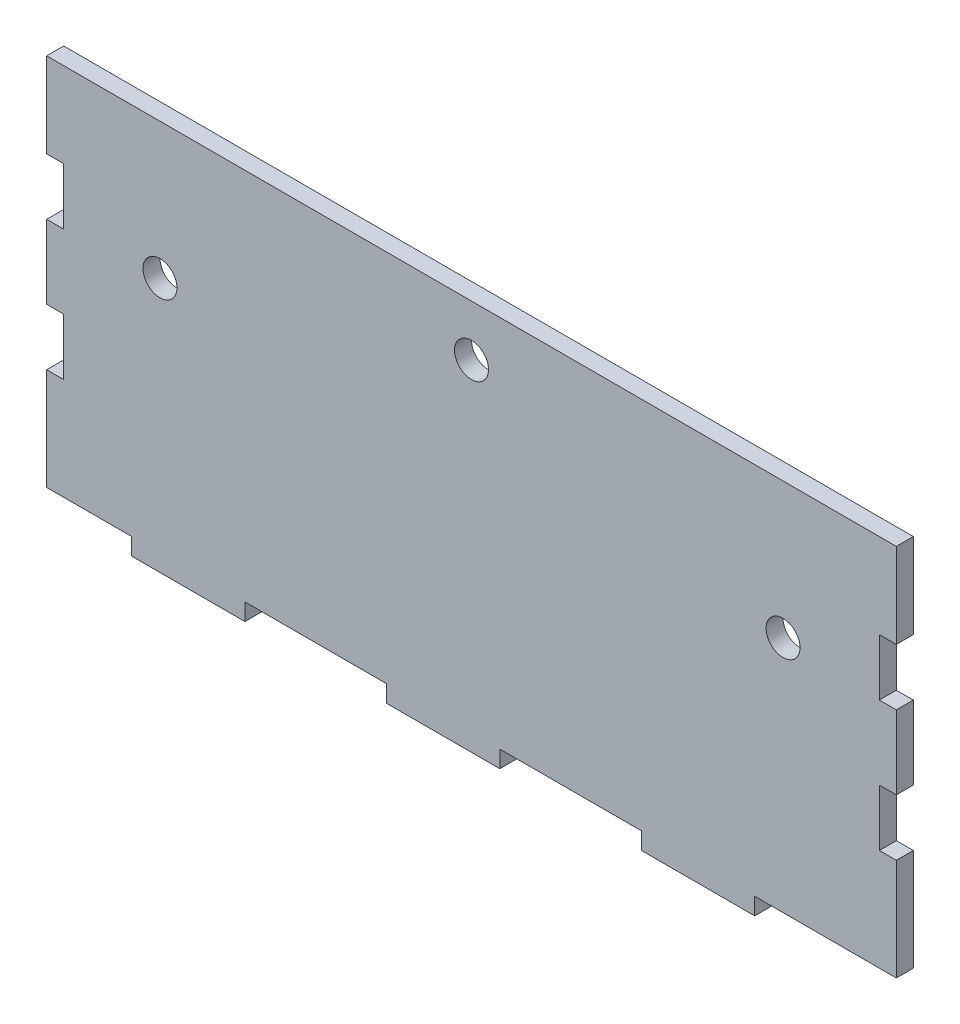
ISO-10303-21;
HEADER;
FILE_DESCRIPTION(('STEP AP214'),'2;1');
FILE_NAME('part.step','',(''),(''),'','','');
FILE_SCHEMA(('AUTOMOTIVE_DESIGN { 1 0 10303 214 1 1 1 1 }'));
ENDSEC;
DATA;
#1=APPLICATION_CONTEXT('core data for automotive mechanical design processes');
#2=APPLICATION_PROTOCOL_DEFINITION('international standard','automotive_design',2000,#1);
#3=PRODUCT_CONTEXT('',#1,'mechanical');
#4=PRODUCT('Part','Part','',(#3));
#5=PRODUCT_RELATED_PRODUCT_CATEGORY('part','',(#4));
#6=PRODUCT_DEFINITION_FORMATION('','',#4);
#7=PRODUCT_DEFINITION_CONTEXT('part definition',#1,'design');
#8=PRODUCT_DEFINITION('design','',#6,#7);
#9=PRODUCT_DEFINITION_SHAPE('','',#8);
#10=(LENGTH_UNIT() NAMED_UNIT(*) SI_UNIT(.MILLI.,.METRE.));
#11=(NAMED_UNIT(*) PLANE_ANGLE_UNIT() SI_UNIT($,.RADIAN.));
#12=(NAMED_UNIT(*) SI_UNIT($,.STERADIAN.) SOLID_ANGLE_UNIT());
#13=UNCERTAINTY_MEASURE_WITH_UNIT(LENGTH_MEASURE(1.E-05),#10,'distance_accuracy_value','');
#14=(GEOMETRIC_REPRESENTATION_CONTEXT(3) GLOBAL_UNCERTAINTY_ASSIGNED_CONTEXT((#13)) GLOBAL_UNIT_ASSIGNED_CONTEXT((#10,
#11,#12)) REPRESENTATION_CONTEXT('',''));
#15=CARTESIAN_POINT('',(0.,0.,0.));
#16=DIRECTION('',(0.,0.,1.));
#17=DIRECTION('',(1.,0.,0.));
#18=AXIS2_PLACEMENT_3D('',#15,#16,#17);
#19=CARTESIAN_POINT('',(0.,0.,3.));
#20=DIRECTION('',(1.,0.,0.));
#21=DIRECTION('',(0.,0.,-1.));
#22=AXIS2_PLACEMENT_3D('',#19,#20,#21);
#23=PLANE('',#22);
#24=DIRECTION('',(0.,-1.,0.));
#25=VECTOR('',#24,1.);
#26=CARTESIAN_POINT('',(0.,0.,3.));
#27=LINE('',#26,#25);
#28=CARTESIAN_POINT('',(0.,44.,3.));
#29=VERTEX_POINT('',#28);
#30=CARTESIAN_POINT('',(0.,31.,3.));
#31=VERTEX_POINT('',#30);
#32=EDGE_CURVE('E277',#29,#31,#27,.T.);
#33=ORIENTED_EDGE('',*,*,#32,.F.);
#34=DIRECTION('',(0.,0.,1.));
#35=VECTOR('',#34,1.);
#36=CARTESIAN_POINT('',(0.,44.,-3.));
#37=LINE('',#36,#35);
#38=CARTESIAN_POINT('',(0.,44.,0.));
#39=VERTEX_POINT('',#38);
#40=EDGE_CURVE('E555',#39,#29,#37,.T.);
#41=ORIENTED_EDGE('',*,*,#40,.F.);
#42=DIRECTION('',(0.,-1.,0.));
#43=VECTOR('',#42,1.);
#44=CARTESIAN_POINT('',(0.,0.,0.));
#45=LINE('',#44,#43);
#46=CARTESIAN_POINT('',(0.,31.,0.));
#47=VERTEX_POINT('',#46);
#48=EDGE_CURVE('E332',#39,#47,#45,.T.);
#49=ORIENTED_EDGE('',*,*,#48,.T.);
#50=DIRECTION('',(0.,0.,1.));
#51=VECTOR('',#50,1.);
#52=CARTESIAN_POINT('',(0.,31.,-3.));
#53=LINE('',#52,#51);
#54=EDGE_CURVE('E562',#47,#31,#53,.T.);
#55=ORIENTED_EDGE('',*,*,#54,.T.);
#56=EDGE_LOOP('',(#33,#41,#49,#55));
#57=FACE_BOUND('',#56,.T.);
#58=ADVANCED_FACE('F39',(#57),#23,.F.);
#59=CARTESIAN_POINT('',(0.,69.,3.));
#60=VERTEX_POINT('',#59);
#61=CARTESIAN_POINT('',(0.,54.,3.));
#62=VERTEX_POINT('',#61);
#63=EDGE_CURVE('E265',#60,#62,#27,.T.);
#64=ORIENTED_EDGE('',*,*,#63,.F.);
#65=DIRECTION('',(0.,0.,1.));
#66=VECTOR('',#65,1.);
#67=CARTESIAN_POINT('',(0.,69.,-3.));
#68=LINE('',#67,#66);
#69=CARTESIAN_POINT('',(0.,69.,0.));
#70=VERTEX_POINT('',#69);
#71=EDGE_CURVE('E247',#70,#60,#68,.T.);
#72=ORIENTED_EDGE('',*,*,#71,.F.);
#73=CARTESIAN_POINT('',(0.,54.,0.));
#74=VERTEX_POINT('',#73);
#75=EDGE_CURVE('E326',#70,#74,#45,.T.);
#76=ORIENTED_EDGE('',*,*,#75,.T.);
#77=DIRECTION('',(0.,0.,1.));
#78=VECTOR('',#77,1.);
#79=CARTESIAN_POINT('',(0.,54.,-3.));
#80=LINE('',#79,#78);
#81=EDGE_CURVE('E274',#74,#62,#80,.T.);
#82=ORIENTED_EDGE('',*,*,#81,.T.);
#83=EDGE_LOOP('',(#64,#72,#76,#82));
#84=FACE_BOUND('',#83,.T.);
#85=ADVANCED_FACE('F273',(#84),#23,.F.);
#86=CARTESIAN_POINT('',(0.,0.,3.));
#87=DIRECTION('',(0.,1.,0.));
#88=DIRECTION('',(0.,0.,1.));
#89=AXIS2_PLACEMENT_3D('',#86,#87,#88);
#90=PLANE('',#89);
#91=DIRECTION('',(1.,0.,0.));
#92=VECTOR('',#91,1.);
#93=CARTESIAN_POINT('',(0.,0.,0.));
#94=LINE('',#93,#92);
#95=CARTESIAN_POINT('',(60.,0.,0.));
#96=VERTEX_POINT('',#95);
#97=CARTESIAN_POINT('',(80.,0.,0.));
#98=VERTEX_POINT('',#97);
#99=EDGE_CURVE('E315',#96,#98,#94,.T.);
#100=ORIENTED_EDGE('',*,*,#99,.T.);
#101=DIRECTION('',(0.,0.,1.));
#102=VECTOR('',#101,1.);
#103=CARTESIAN_POINT('',(80.,0.,-3.));
#104=LINE('',#103,#102);
#105=CARTESIAN_POINT('',(80.,0.,3.));
#106=VERTEX_POINT('',#105);
#107=EDGE_CURVE('E459',#98,#106,#104,.T.);
#108=ORIENTED_EDGE('',*,*,#107,.T.);
#109=DIRECTION('',(1.,0.,0.));
#110=VECTOR('',#109,1.);
#111=CARTESIAN_POINT('',(0.,0.,3.));
#112=LINE('',#111,#110);
#113=CARTESIAN_POINT('',(60.,0.,3.));
#114=VERTEX_POINT('',#113);
#115=EDGE_CURVE('E283',#114,#106,#112,.T.);
#116=ORIENTED_EDGE('',*,*,#115,.F.);
#117=DIRECTION('',(0.,0.,1.));
#118=VECTOR('',#117,1.);
#119=CARTESIAN_POINT('',(60.,0.,-3.));
#120=LINE('',#119,#118);
#121=EDGE_CURVE('E457',#96,#114,#120,.T.);
#122=ORIENTED_EDGE('',*,*,#121,.F.);
#123=EDGE_LOOP('',(#100,#108,#116,#122));
#124=FACE_BOUND('',#123,.T.);
#125=ADVANCED_FACE('F456',(#124),#90,.F.);
#126=CARTESIAN_POINT('',(15.,0.,0.));
#127=VERTEX_POINT('',#126);
#128=CARTESIAN_POINT('',(35.,0.,0.));
#129=VERTEX_POINT('',#128);
#130=EDGE_CURVE('E309',#127,#129,#94,.T.);
#131=ORIENTED_EDGE('',*,*,#130,.T.);
#132=DIRECTION('',(0.,0.,1.));
#133=VECTOR('',#132,1.);
#134=CARTESIAN_POINT('',(35.,0.,-3.));
#135=LINE('',#134,#133);
#136=CARTESIAN_POINT('',(35.,0.,3.));
#137=VERTEX_POINT('',#136);
#138=EDGE_CURVE('E485',#129,#137,#135,.T.);
#139=ORIENTED_EDGE('',*,*,#138,.T.);
#140=CARTESIAN_POINT('',(15.,0.,3.));
#141=VERTEX_POINT('',#140);
#142=EDGE_CURVE('E285',#141,#137,#112,.T.);
#143=ORIENTED_EDGE('',*,*,#142,.F.);
#144=DIRECTION('',(0.,0.,1.));
#145=VECTOR('',#144,1.);
#146=CARTESIAN_POINT('',(15.,0.,-3.));
#147=LINE('',#146,#145);
#148=EDGE_CURVE('E542',#127,#141,#147,.T.);
#149=ORIENTED_EDGE('',*,*,#148,.F.);
#150=EDGE_LOOP('',(#131,#139,#143,#149));
#151=FACE_BOUND('',#150,.T.);
#152=ADVANCED_FACE('F494',(#151),#90,.F.);
#153=CARTESIAN_POINT('',(150.,0.,3.));
#154=DIRECTION('',(-1.,0.,0.));
#155=DIRECTION('',(0.,0.,1.));
#156=AXIS2_PLACEMENT_3D('',#153,#154,#155);
#157=PLANE('',#156);
#158=DIRECTION('',(0.,1.,0.));
#159=VECTOR('',#158,1.);
#160=CARTESIAN_POINT('',(150.,0.,0.));
#161=LINE('',#160,#159);
#162=CARTESIAN_POINT('',(150.,31.,0.));
#163=VERTEX_POINT('',#162);
#164=CARTESIAN_POINT('',(150.,44.,0.));
#165=VERTEX_POINT('',#164);
#166=EDGE_CURVE('E296',#163,#165,#161,.T.);
#167=ORIENTED_EDGE('',*,*,#166,.T.);
#168=DIRECTION('',(0.,0.,1.));
#169=VECTOR('',#168,1.);
#170=CARTESIAN_POINT('',(150.,44.,-3.));
#171=LINE('',#170,#169);
#172=CARTESIAN_POINT('',(150.,44.,3.));
#173=VERTEX_POINT('',#172);
#174=EDGE_CURVE('E270',#165,#173,#171,.T.);
#175=ORIENTED_EDGE('',*,*,#174,.T.);
#176=DIRECTION('',(0.,1.,0.));
#177=VECTOR('',#176,1.);
#178=CARTESIAN_POINT('',(150.,0.,3.));
#179=LINE('',#178,#177);
#180=CARTESIAN_POINT('',(150.,31.,3.));
#181=VERTEX_POINT('',#180);
#182=EDGE_CURVE('E431',#181,#173,#179,.T.);
#183=ORIENTED_EDGE('',*,*,#182,.F.);
#184=DIRECTION('',(0.,0.,1.));
#185=VECTOR('',#184,1.);
#186=CARTESIAN_POINT('',(150.,31.,-3.));
#187=LINE('',#186,#185);
#188=EDGE_CURVE('E636',#163,#181,#187,.T.);
#189=ORIENTED_EDGE('',*,*,#188,.F.);
#190=EDGE_LOOP('',(#167,#175,#183,#189));
#191=FACE_BOUND('',#190,.T.);
#192=ADVANCED_FACE('F533',(#191),#157,.F.);
#193=CARTESIAN_POINT('',(150.,54.,0.));
#194=VERTEX_POINT('',#193);
#195=CARTESIAN_POINT('',(150.,69.,0.));
#196=VERTEX_POINT('',#195);
#197=EDGE_CURVE('E298',#194,#196,#161,.T.);
#198=ORIENTED_EDGE('',*,*,#197,.T.);
#199=DIRECTION('',(0.,0.,1.));
#200=VECTOR('',#199,1.);
#201=CARTESIAN_POINT('',(150.,69.,-3.));
#202=LINE('',#201,#200);
#203=CARTESIAN_POINT('',(150.,69.,3.));
#204=VERTEX_POINT('',#203);
#205=EDGE_CURVE('E258',#196,#204,#202,.T.);
#206=ORIENTED_EDGE('',*,*,#205,.T.);
#207=CARTESIAN_POINT('',(150.,54.,3.));
#208=VERTEX_POINT('',#207);
#209=EDGE_CURVE('E268',#208,#204,#179,.T.);
#210=ORIENTED_EDGE('',*,*,#209,.F.);
#211=DIRECTION('',(0.,0.,1.));
#212=VECTOR('',#211,1.);
#213=CARTESIAN_POINT('',(150.,54.,-3.));
#214=LINE('',#213,#212);
#215=EDGE_CURVE('E585',#194,#208,#214,.T.);
#216=ORIENTED_EDGE('',*,*,#215,.F.);
#217=EDGE_LOOP('',(#198,#206,#210,#216));
#218=FACE_BOUND('',#217,.T.);
#219=ADVANCED_FACE('F527',(#218),#157,.F.);
#220=CARTESIAN_POINT('',(0.,21.,3.));
#221=VERTEX_POINT('',#220);
#222=CARTESIAN_POINT('',(0.,3.,3.));
#223=VERTEX_POINT('',#222);
#224=EDGE_CURVE('E279',#221,#223,#27,.T.);
#225=ORIENTED_EDGE('',*,*,#224,.F.);
#226=DIRECTION('',(0.,0.,1.));
#227=VECTOR('',#226,1.);
#228=CARTESIAN_POINT('',(0.,21.,-3.));
#229=LINE('',#228,#227);
#230=CARTESIAN_POINT('',(0.,21.,0.));
#231=VERTEX_POINT('',#230);
#232=EDGE_CURVE('E535',#231,#221,#229,.T.);
#233=ORIENTED_EDGE('',*,*,#232,.F.);
#234=CARTESIAN_POINT('',(0.,3.,0.));
#235=VERTEX_POINT('',#234);
#236=EDGE_CURVE('E333',#231,#235,#45,.T.);
#237=ORIENTED_EDGE('',*,*,#236,.T.);
#238=DIRECTION('',(0.,0.,1.));
#239=VECTOR('',#238,1.);
#240=CARTESIAN_POINT('',(0.,3.,-3.));
#241=LINE('',#240,#239);
#242=EDGE_CURVE('E478',#235,#223,#241,.T.);
#243=ORIENTED_EDGE('',*,*,#242,.T.);
#244=EDGE_LOOP('',(#225,#233,#237,#243));
#245=FACE_BOUND('',#244,.T.);
#246=ADVANCED_FACE('F41',(#245),#23,.F.);
#247=CARTESIAN_POINT('',(105.,0.,0.));
#248=VERTEX_POINT('',#247);
#249=CARTESIAN_POINT('',(125.,0.,0.));
#250=VERTEX_POINT('',#249);
#251=EDGE_CURVE('E316',#248,#250,#94,.T.);
#252=ORIENTED_EDGE('',*,*,#251,.T.);
#253=DIRECTION('',(0.,0.,1.));
#254=VECTOR('',#253,1.);
#255=CARTESIAN_POINT('',(125.,0.,-3.));
#256=LINE('',#255,#254);
#257=CARTESIAN_POINT('',(125.,0.,3.));
#258=VERTEX_POINT('',#257);
#259=EDGE_CURVE('E603',#250,#258,#256,.T.);
#260=ORIENTED_EDGE('',*,*,#259,.T.);
#261=CARTESIAN_POINT('',(105.,0.,3.));
#262=VERTEX_POINT('',#261);
#263=EDGE_CURVE('E276',#262,#258,#112,.T.);
#264=ORIENTED_EDGE('',*,*,#263,.F.);
#265=DIRECTION('',(0.,0.,1.));
#266=VECTOR('',#265,1.);
#267=CARTESIAN_POINT('',(105.,0.,-3.));
#268=LINE('',#267,#266);
#269=EDGE_CURVE('E463',#248,#262,#268,.T.);
#270=ORIENTED_EDGE('',*,*,#269,.F.);
#271=EDGE_LOOP('',(#252,#260,#264,#270));
#272=FACE_BOUND('',#271,.T.);
#273=ADVANCED_FACE('F526',(#272),#90,.F.);
#274=CARTESIAN_POINT('',(150.,3.,3.));
#275=VERTEX_POINT('',#274);
#276=CARTESIAN_POINT('',(150.,21.,3.));
#277=VERTEX_POINT('',#276);
#278=EDGE_CURVE('E426',#275,#277,#179,.T.);
#279=ORIENTED_EDGE('',*,*,#278,.F.);
#280=DIRECTION('',(0.,0.,1.));
#281=VECTOR('',#280,1.);
#282=CARTESIAN_POINT('',(150.,3.,-3.));
#283=LINE('',#282,#281);
#284=CARTESIAN_POINT('',(150.,3.,0.));
#285=VERTEX_POINT('',#284);
#286=EDGE_CURVE('E606',#285,#275,#283,.T.);
#287=ORIENTED_EDGE('',*,*,#286,.F.);
#288=CARTESIAN_POINT('',(150.,21.,0.));
#289=VERTEX_POINT('',#288);
#290=EDGE_CURVE('E290',#285,#289,#161,.T.);
#291=ORIENTED_EDGE('',*,*,#290,.T.);
#292=DIRECTION('',(0.,0.,1.));
#293=VECTOR('',#292,1.);
#294=CARTESIAN_POINT('',(150.,21.,-3.));
#295=LINE('',#294,#293);
#296=EDGE_CURVE('E633',#289,#277,#295,.T.);
#297=ORIENTED_EDGE('',*,*,#296,.T.);
#298=EDGE_LOOP('',(#279,#287,#291,#297));
#299=FACE_BOUND('',#298,.T.);
#300=ADVANCED_FACE('F532',(#299),#157,.F.);
#301=CARTESIAN_POINT('',(0.,0.,3.));
#302=DIRECTION('',(0.,0.,-1.));
#303=DIRECTION('',(-1.,0.,0.));
#304=AXIS2_PLACEMENT_3D('',#301,#302,#303);
#305=PLANE('',#304);
#306=CARTESIAN_POINT('',(20.,45.,3.));
#307=DIRECTION('',(0.,0.,1.));
#308=DIRECTION('',(-1.,0.,0.));
#309=AXIS2_PLACEMENT_3D('',#306,#307,#308);
#310=CIRCLE('',#309,2.99999999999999);
#311=CARTESIAN_POINT('',(17.,45.,3.));
#312=VERTEX_POINT('',#311);
#313=EDGE_CURVE('E938',#312,#312,#310,.T.);
#314=ORIENTED_EDGE('',*,*,#313,.F.);
#315=EDGE_LOOP('',(#314));
#316=FACE_BOUND('',#315,.T.);
#317=CARTESIAN_POINT('',(130.,45.,3.));
#318=DIRECTION('',(0.,0.,1.));
#319=DIRECTION('',(1.,0.,0.));
#320=AXIS2_PLACEMENT_3D('',#317,#318,#319);
#321=CIRCLE('',#320,2.99999999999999);
#322=CARTESIAN_POINT('',(133.,45.,3.));
#323=VERTEX_POINT('',#322);
#324=EDGE_CURVE('E942',#323,#323,#321,.T.);
#325=ORIENTED_EDGE('',*,*,#324,.F.);
#326=EDGE_LOOP('',(#325));
#327=FACE_BOUND('',#326,.T.);
#328=CARTESIAN_POINT('',(75.,60.,3.));
#329=DIRECTION('',(0.,0.,1.));
#330=DIRECTION('',(1.,0.,0.));
#331=AXIS2_PLACEMENT_3D('',#328,#329,#330);
#332=CIRCLE('',#331,3.00000000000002);
#333=CARTESIAN_POINT('',(78.,60.,3.));
#334=VERTEX_POINT('',#333);
#335=EDGE_CURVE('E945',#334,#334,#332,.T.);
#336=ORIENTED_EDGE('',*,*,#335,.F.);
#337=EDGE_LOOP('',(#336));
#338=FACE_BOUND('',#337,.T.);
#339=ORIENTED_EDGE('',*,*,#209,.T.);
#340=DIRECTION('',(1.,0.,0.));
#341=VECTOR('',#340,1.);
#342=CARTESIAN_POINT('',(150.,69.,3.));
#343=LINE('',#342,#341);
#344=EDGE_CURVE('E250',#60,#204,#343,.T.);
#345=ORIENTED_EDGE('',*,*,#344,.F.);
#346=ORIENTED_EDGE('',*,*,#63,.T.);
#347=DIRECTION('',(-1.,0.,0.));
#348=VECTOR('',#347,1.);
#349=CARTESIAN_POINT('',(0.,54.,3.));
#350=LINE('',#349,#348);
#351=CARTESIAN_POINT('',(3.,54.,3.));
#352=VERTEX_POINT('',#351);
#353=EDGE_CURVE('E967',#352,#62,#350,.T.);
#354=ORIENTED_EDGE('',*,*,#353,.F.);
#355=DIRECTION('',(0.,1.,0.));
#356=VECTOR('',#355,1.);
#357=CARTESIAN_POINT('',(3.,54.,3.));
#358=LINE('',#357,#356);
#359=CARTESIAN_POINT('',(3.,44.,3.));
#360=VERTEX_POINT('',#359);
#361=EDGE_CURVE('E963',#360,#352,#358,.T.);
#362=ORIENTED_EDGE('',*,*,#361,.F.);
#363=DIRECTION('',(1.,0.,0.));
#364=VECTOR('',#363,1.);
#365=CARTESIAN_POINT('',(3.,44.,3.));
#366=LINE('',#365,#364);
#367=EDGE_CURVE('E641',#29,#360,#366,.T.);
#368=ORIENTED_EDGE('',*,*,#367,.F.);
#369=ORIENTED_EDGE('',*,*,#32,.T.);
#370=DIRECTION('',(-1.,0.,0.));
#371=VECTOR('',#370,1.);
#372=CARTESIAN_POINT('',(3.,31.,3.));
#373=LINE('',#372,#371);
#374=CARTESIAN_POINT('',(3.,31.,3.));
#375=VERTEX_POINT('',#374);
#376=EDGE_CURVE('E559',#375,#31,#373,.T.);
#377=ORIENTED_EDGE('',*,*,#376,.F.);
#378=DIRECTION('',(0.,1.,0.));
#379=VECTOR('',#378,1.);
#380=CARTESIAN_POINT('',(3.,21.,3.));
#381=LINE('',#380,#379);
#382=CARTESIAN_POINT('',(3.,21.,3.));
#383=VERTEX_POINT('',#382);
#384=EDGE_CURVE('E554',#383,#375,#381,.T.);
#385=ORIENTED_EDGE('',*,*,#384,.F.);
#386=DIRECTION('',(1.,0.,0.));
#387=VECTOR('',#386,1.);
#388=CARTESIAN_POINT('',(0.,21.,3.));
#389=LINE('',#388,#387);
#390=EDGE_CURVE('E550',#221,#383,#389,.T.);
#391=ORIENTED_EDGE('',*,*,#390,.F.);
#392=ORIENTED_EDGE('',*,*,#224,.T.);
#393=DIRECTION('',(-1.,0.,0.));
#394=VECTOR('',#393,1.);
#395=CARTESIAN_POINT('',(0.,3.,3.));
#396=LINE('',#395,#394);
#397=CARTESIAN_POINT('',(15.,3.,3.));
#398=VERTEX_POINT('',#397);
#399=EDGE_CURVE('E545',#398,#223,#396,.T.);
#400=ORIENTED_EDGE('',*,*,#399,.F.);
#401=DIRECTION('',(0.,1.,0.));
#402=VECTOR('',#401,1.);
#403=CARTESIAN_POINT('',(15.,3.,3.));
#404=LINE('',#403,#402);
#405=EDGE_CURVE('E566',#141,#398,#404,.T.);
#406=ORIENTED_EDGE('',*,*,#405,.F.);
#407=ORIENTED_EDGE('',*,*,#142,.T.);
#408=DIRECTION('',(0.,-1.,0.));
#409=VECTOR('',#408,1.);
#410=CARTESIAN_POINT('',(35.,0.,3.));
#411=LINE('',#410,#409);
#412=CARTESIAN_POINT('',(35.,3.,3.));
#413=VERTEX_POINT('',#412);
#414=EDGE_CURVE('E475',#413,#137,#411,.T.);
#415=ORIENTED_EDGE('',*,*,#414,.F.);
#416=DIRECTION('',(-1.,0.,0.));
#417=VECTOR('',#416,1.);
#418=CARTESIAN_POINT('',(35.,3.,3.));
#419=LINE('',#418,#417);
#420=CARTESIAN_POINT('',(60.,3.,3.));
#421=VERTEX_POINT('',#420);
#422=EDGE_CURVE('E481',#421,#413,#419,.T.);
#423=ORIENTED_EDGE('',*,*,#422,.F.);
#424=DIRECTION('',(0.,1.,0.));
#425=VECTOR('',#424,1.);
#426=CARTESIAN_POINT('',(60.,3.,3.));
#427=LINE('',#426,#425);
#428=EDGE_CURVE('E452',#114,#421,#427,.T.);
#429=ORIENTED_EDGE('',*,*,#428,.F.);
#430=ORIENTED_EDGE('',*,*,#115,.T.);
#431=DIRECTION('',(0.,-1.,0.));
#432=VECTOR('',#431,1.);
#433=CARTESIAN_POINT('',(80.,0.,3.));
#434=LINE('',#433,#432);
#435=CARTESIAN_POINT('',(80.,3.,3.));
#436=VERTEX_POINT('',#435);
#437=EDGE_CURVE('E449',#436,#106,#434,.T.);
#438=ORIENTED_EDGE('',*,*,#437,.F.);
#439=DIRECTION('',(-1.,0.,0.));
#440=VECTOR('',#439,1.);
#441=CARTESIAN_POINT('',(80.,3.,3.));
#442=LINE('',#441,#440);
#443=CARTESIAN_POINT('',(105.,3.,3.));
#444=VERTEX_POINT('',#443);
#445=EDGE_CURVE('E464',#444,#436,#442,.T.);
#446=ORIENTED_EDGE('',*,*,#445,.F.);
#447=DIRECTION('',(0.,1.,0.));
#448=VECTOR('',#447,1.);
#449=CARTESIAN_POINT('',(105.,3.,3.));
#450=LINE('',#449,#448);
#451=EDGE_CURVE('E471',#262,#444,#450,.T.);
#452=ORIENTED_EDGE('',*,*,#451,.F.);
#453=ORIENTED_EDGE('',*,*,#263,.T.);
#454=DIRECTION('',(0.,-1.,0.));
#455=VECTOR('',#454,1.);
#456=CARTESIAN_POINT('',(125.,0.,3.));
#457=LINE('',#456,#455);
#458=CARTESIAN_POINT('',(125.,3.,3.));
#459=VERTEX_POINT('',#458);
#460=EDGE_CURVE('E596',#459,#258,#457,.T.);
#461=ORIENTED_EDGE('',*,*,#460,.F.);
#462=DIRECTION('',(-1.,0.,0.));
#463=VECTOR('',#462,1.);
#464=CARTESIAN_POINT('',(125.,3.,3.));
#465=LINE('',#464,#463);
#466=EDGE_CURVE('E599',#275,#459,#465,.T.);
#467=ORIENTED_EDGE('',*,*,#466,.F.);
#468=ORIENTED_EDGE('',*,*,#278,.T.);
#469=DIRECTION('',(1.,0.,0.));
#470=VECTOR('',#469,1.);
#471=CARTESIAN_POINT('',(150.,21.,3.));
#472=LINE('',#471,#470);
#473=CARTESIAN_POINT('',(147.,21.,3.));
#474=VERTEX_POINT('',#473);
#475=EDGE_CURVE('E648',#474,#277,#472,.T.);
#476=ORIENTED_EDGE('',*,*,#475,.F.);
#477=DIRECTION('',(0.,-1.,0.));
#478=VECTOR('',#477,1.);
#479=CARTESIAN_POINT('',(147.,21.,3.));
#480=LINE('',#479,#478);
#481=CARTESIAN_POINT('',(147.,31.,3.));
#482=VERTEX_POINT('',#481);
#483=EDGE_CURVE('E953',#482,#474,#480,.T.);
#484=ORIENTED_EDGE('',*,*,#483,.F.);
#485=DIRECTION('',(-1.,0.,0.));
#486=VECTOR('',#485,1.);
#487=CARTESIAN_POINT('',(147.,31.,3.));
#488=LINE('',#487,#486);
#489=EDGE_CURVE('E948',#181,#482,#488,.T.);
#490=ORIENTED_EDGE('',*,*,#489,.F.);
#491=ORIENTED_EDGE('',*,*,#182,.T.);
#492=DIRECTION('',(1.,0.,0.));
#493=VECTOR('',#492,1.);
#494=CARTESIAN_POINT('',(147.,44.,3.));
#495=LINE('',#494,#493);
#496=CARTESIAN_POINT('',(147.,44.,3.));
#497=VERTEX_POINT('',#496);
#498=EDGE_CURVE('E582',#497,#173,#495,.T.);
#499=ORIENTED_EDGE('',*,*,#498,.F.);
#500=DIRECTION('',(0.,-1.,0.));
#501=VECTOR('',#500,1.);
#502=CARTESIAN_POINT('',(147.,54.,3.));
#503=LINE('',#502,#501);
#504=CARTESIAN_POINT('',(147.,54.,3.));
#505=VERTEX_POINT('',#504);
#506=EDGE_CURVE('E578',#505,#497,#503,.T.);
#507=ORIENTED_EDGE('',*,*,#506,.F.);
#508=DIRECTION('',(-1.,0.,0.));
#509=VECTOR('',#508,1.);
#510=CARTESIAN_POINT('',(150.,54.,3.));
#511=LINE('',#510,#509);
#512=EDGE_CURVE('E575',#208,#505,#511,.T.);
#513=ORIENTED_EDGE('',*,*,#512,.F.);
#514=EDGE_LOOP('',(#339,#345,#346,#354,#362,#368,#369,#377,#385,#391,#392,#400,#406,#407,#415,
#423,#429,#430,#438,#446,#452,#453,#461,#467,#468,#476,#484,#490,#491,#499,#507,#513));
#515=FACE_BOUND('',#514,.T.);
#516=ADVANCED_FACE('F263',(#316,#327,#338,#515),#305,.F.);
#517=CARTESIAN_POINT('',(0.,0.,0.));
#518=DIRECTION('',(0.,0.,-1.));
#519=DIRECTION('',(-1.,0.,0.));
#520=AXIS2_PLACEMENT_3D('',#517,#518,#519);
#521=PLANE('',#520);
#522=DIRECTION('',(-1.,0.,0.));
#523=VECTOR('',#522,1.);
#524=CARTESIAN_POINT('',(0.,69.,0.));
#525=LINE('',#524,#523);
#526=EDGE_CURVE('E11',#196,#70,#525,.T.);
#527=ORIENTED_EDGE('',*,*,#526,.F.);
#528=ORIENTED_EDGE('',*,*,#197,.F.);
#529=DIRECTION('',(1.,0.,0.));
#530=VECTOR('',#529,1.);
#531=CARTESIAN_POINT('',(0.,54.,0.));
#532=LINE('',#531,#530);
#533=CARTESIAN_POINT('',(147.,54.,0.));
#534=VERTEX_POINT('',#533);
#535=EDGE_CURVE('E362',#534,#194,#532,.T.);
#536=ORIENTED_EDGE('',*,*,#535,.F.);
#537=DIRECTION('',(0.,1.,0.));
#538=VECTOR('',#537,1.);
#539=CARTESIAN_POINT('',(147.,0.,0.));
#540=LINE('',#539,#538);
#541=CARTESIAN_POINT('',(147.,44.,0.));
#542=VERTEX_POINT('',#541);
#543=EDGE_CURVE('E359',#542,#534,#540,.T.);
#544=ORIENTED_EDGE('',*,*,#543,.F.);
#545=DIRECTION('',(-1.,0.,0.));
#546=VECTOR('',#545,1.);
#547=CARTESIAN_POINT('',(0.,44.,0.));
#548=LINE('',#547,#546);
#549=EDGE_CURVE('E48',#165,#542,#548,.T.);
#550=ORIENTED_EDGE('',*,*,#549,.F.);
#551=ORIENTED_EDGE('',*,*,#166,.F.);
#552=DIRECTION('',(1.,0.,0.));
#553=VECTOR('',#552,1.);
#554=CARTESIAN_POINT('',(0.,31.,0.));
#555=LINE('',#554,#553);
#556=CARTESIAN_POINT('',(147.,31.,0.));
#557=VERTEX_POINT('',#556);
#558=EDGE_CURVE('E391',#557,#163,#555,.T.);
#559=ORIENTED_EDGE('',*,*,#558,.F.);
#560=DIRECTION('',(0.,1.,0.));
#561=VECTOR('',#560,1.);
#562=CARTESIAN_POINT('',(147.,0.,0.));
#563=LINE('',#562,#561);
#564=CARTESIAN_POINT('',(147.,21.,0.));
#565=VERTEX_POINT('',#564);
#566=EDGE_CURVE('E398',#565,#557,#563,.T.);
#567=ORIENTED_EDGE('',*,*,#566,.F.);
#568=DIRECTION('',(-1.,0.,0.));
#569=VECTOR('',#568,1.);
#570=CARTESIAN_POINT('',(0.,21.,0.));
#571=LINE('',#570,#569);
#572=EDGE_CURVE('E394',#289,#565,#571,.T.);
#573=ORIENTED_EDGE('',*,*,#572,.F.);
#574=ORIENTED_EDGE('',*,*,#290,.F.);
#575=DIRECTION('',(1.,0.,0.));
#576=VECTOR('',#575,1.);
#577=CARTESIAN_POINT('',(0.,3.,0.));
#578=LINE('',#577,#576);
#579=CARTESIAN_POINT('',(125.,3.,0.));
#580=VERTEX_POINT('',#579);
#581=EDGE_CURVE('E368',#580,#285,#578,.T.);
#582=ORIENTED_EDGE('',*,*,#581,.F.);
#583=DIRECTION('',(0.,1.,0.));
#584=VECTOR('',#583,1.);
#585=CARTESIAN_POINT('',(125.,0.,0.));
#586=LINE('',#585,#584);
#587=EDGE_CURVE('E365',#250,#580,#586,.T.);
#588=ORIENTED_EDGE('',*,*,#587,.F.);
#589=ORIENTED_EDGE('',*,*,#251,.F.);
#590=DIRECTION('',(0.,-1.,0.));
#591=VECTOR('',#590,1.);
#592=CARTESIAN_POINT('',(105.,0.,0.));
#593=LINE('',#592,#591);
#594=CARTESIAN_POINT('',(105.,3.,0.));
#595=VERTEX_POINT('',#594);
#596=EDGE_CURVE('E378',#595,#248,#593,.T.);
#597=ORIENTED_EDGE('',*,*,#596,.F.);
#598=DIRECTION('',(1.,0.,0.));
#599=VECTOR('',#598,1.);
#600=CARTESIAN_POINT('',(0.,3.,0.));
#601=LINE('',#600,#599);
#602=CARTESIAN_POINT('',(80.,3.,0.));
#603=VERTEX_POINT('',#602);
#604=EDGE_CURVE('E374',#603,#595,#601,.T.);
#605=ORIENTED_EDGE('',*,*,#604,.F.);
#606=DIRECTION('',(0.,1.,0.));
#607=VECTOR('',#606,1.);
#608=CARTESIAN_POINT('',(80.,0.,0.));
#609=LINE('',#608,#607);
#610=EDGE_CURVE('E371',#98,#603,#609,.T.);
#611=ORIENTED_EDGE('',*,*,#610,.F.);
#612=ORIENTED_EDGE('',*,*,#99,.F.);
#613=DIRECTION('',(0.,-1.,0.));
#614=VECTOR('',#613,1.);
#615=CARTESIAN_POINT('',(60.,0.,0.));
#616=LINE('',#615,#614);
#617=CARTESIAN_POINT('',(60.,3.,0.));
#618=VERTEX_POINT('',#617);
#619=EDGE_CURVE('E388',#618,#96,#616,.T.);
#620=ORIENTED_EDGE('',*,*,#619,.F.);
#621=DIRECTION('',(1.,0.,0.));
#622=VECTOR('',#621,1.);
#623=CARTESIAN_POINT('',(0.,3.,0.));
#624=LINE('',#623,#622);
#625=CARTESIAN_POINT('',(35.,3.,0.));
#626=VERTEX_POINT('',#625);
#627=EDGE_CURVE('E384',#626,#618,#624,.T.);
#628=ORIENTED_EDGE('',*,*,#627,.F.);
#629=DIRECTION('',(0.,1.,0.));
#630=VECTOR('',#629,1.);
#631=CARTESIAN_POINT('',(35.,0.,0.));
#632=LINE('',#631,#630);
#633=EDGE_CURVE('E381',#129,#626,#632,.T.);
#634=ORIENTED_EDGE('',*,*,#633,.F.);
#635=ORIENTED_EDGE('',*,*,#130,.F.);
#636=DIRECTION('',(0.,-1.,0.));
#637=VECTOR('',#636,1.);
#638=CARTESIAN_POINT('',(15.,0.,0.));
#639=LINE('',#638,#637);
#640=CARTESIAN_POINT('',(15.,3.,0.));
#641=VERTEX_POINT('',#640);
#642=EDGE_CURVE('E424',#641,#127,#639,.T.);
#643=ORIENTED_EDGE('',*,*,#642,.F.);
#644=DIRECTION('',(1.,0.,0.));
#645=VECTOR('',#644,1.);
#646=CARTESIAN_POINT('',(0.,3.,0.));
#647=LINE('',#646,#645);
#648=EDGE_CURVE('E421',#235,#641,#647,.T.);
#649=ORIENTED_EDGE('',*,*,#648,.F.);
#650=ORIENTED_EDGE('',*,*,#236,.F.);
#651=DIRECTION('',(-1.,0.,0.));
#652=VECTOR('',#651,1.);
#653=CARTESIAN_POINT('',(0.,21.,0.));
#654=LINE('',#653,#652);
#655=CARTESIAN_POINT('',(3.,21.,0.));
#656=VERTEX_POINT('',#655);
#657=EDGE_CURVE('E418',#656,#231,#654,.T.);
#658=ORIENTED_EDGE('',*,*,#657,.F.);
#659=DIRECTION('',(0.,-1.,0.));
#660=VECTOR('',#659,1.);
#661=CARTESIAN_POINT('',(3.,0.,0.));
#662=LINE('',#661,#660);
#663=CARTESIAN_POINT('',(3.,31.,0.));
#664=VERTEX_POINT('',#663);
#665=EDGE_CURVE('E414',#664,#656,#662,.T.);
#666=ORIENTED_EDGE('',*,*,#665,.F.);
#667=DIRECTION('',(1.,0.,0.));
#668=VECTOR('',#667,1.);
#669=CARTESIAN_POINT('',(0.,31.,0.));
#670=LINE('',#669,#668);
#671=EDGE_CURVE('E411',#47,#664,#670,.T.);
#672=ORIENTED_EDGE('',*,*,#671,.F.);
#673=ORIENTED_EDGE('',*,*,#48,.F.);
#674=DIRECTION('',(-1.,0.,0.));
#675=VECTOR('',#674,1.);
#676=CARTESIAN_POINT('',(0.,44.,0.));
#677=LINE('',#676,#675);
#678=CARTESIAN_POINT('',(3.,44.,0.));
#679=VERTEX_POINT('',#678);
#680=EDGE_CURVE('E401',#679,#39,#677,.T.);
#681=ORIENTED_EDGE('',*,*,#680,.F.);
#682=DIRECTION('',(0.,-1.,0.));
#683=VECTOR('',#682,1.);
#684=CARTESIAN_POINT('',(3.,0.,0.));
#685=LINE('',#684,#683);
#686=CARTESIAN_POINT('',(3.,54.,0.));
#687=VERTEX_POINT('',#686);
#688=EDGE_CURVE('E408',#687,#679,#685,.T.);
#689=ORIENTED_EDGE('',*,*,#688,.F.);
#690=DIRECTION('',(1.,0.,0.));
#691=VECTOR('',#690,1.);
#692=CARTESIAN_POINT('',(0.,54.,0.));
#693=LINE('',#692,#691);
#694=EDGE_CURVE('E404',#74,#687,#693,.T.);
#695=ORIENTED_EDGE('',*,*,#694,.F.);
#696=ORIENTED_EDGE('',*,*,#75,.F.);
#697=EDGE_LOOP('',(#527,#528,#536,#544,#550,#551,#559,#567,#573,#574,#582,#588,#589,#597,#605,
#611,#612,#620,#628,#634,#635,#643,#649,#650,#658,#666,#672,#673,#681,#689,#695,#696));
#698=FACE_BOUND('',#697,.T.);
#699=CARTESIAN_POINT('',(20.,45.,0.));
#700=DIRECTION('',(0.,0.,-1.));
#701=DIRECTION('',(-1.,0.,0.));
#702=AXIS2_PLACEMENT_3D('',#699,#700,#701);
#703=CIRCLE('',#702,2.99999999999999);
#704=CARTESIAN_POINT('',(17.,45.,0.));
#705=VERTEX_POINT('',#704);
#706=EDGE_CURVE('E339',#705,#705,#703,.T.);
#707=ORIENTED_EDGE('',*,*,#706,.F.);
#708=EDGE_LOOP('',(#707));
#709=FACE_BOUND('',#708,.T.);
#710=CARTESIAN_POINT('',(130.,45.,0.));
#711=DIRECTION('',(0.,0.,-1.));
#712=DIRECTION('',(-1.,0.,0.));
#713=AXIS2_PLACEMENT_3D('',#710,#711,#712);
#714=CIRCLE('',#713,2.99999999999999);
#715=CARTESIAN_POINT('',(127.,45.,0.));
#716=VERTEX_POINT('',#715);
#717=EDGE_CURVE('E346',#716,#716,#714,.T.);
#718=ORIENTED_EDGE('',*,*,#717,.F.);
#719=EDGE_LOOP('',(#718));
#720=FACE_BOUND('',#719,.T.);
#721=CARTESIAN_POINT('',(75.,60.,0.));
#722=DIRECTION('',(0.,0.,-1.));
#723=DIRECTION('',(-1.,0.,0.));
#724=AXIS2_PLACEMENT_3D('',#721,#722,#723);
#725=CIRCLE('',#724,3.00000000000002);
#726=CARTESIAN_POINT('',(72.,60.,0.));
#727=VERTEX_POINT('',#726);
#728=EDGE_CURVE('E351',#727,#727,#725,.T.);
#729=ORIENTED_EDGE('',*,*,#728,.F.);
#730=EDGE_LOOP('',(#729));
#731=FACE_BOUND('',#730,.T.);
#732=ADVANCED_FACE('F501',(#698,#709,#720,#731),#521,.T.);
#733=CARTESIAN_POINT('',(0.,3.,-3.));
#734=DIRECTION('',(0.,1.,0.));
#735=DIRECTION('',(0.,0.,1.));
#736=AXIS2_PLACEMENT_3D('',#733,#734,#735);
#737=PLANE('',#736);
#738=ORIENTED_EDGE('',*,*,#648,.T.);
#739=DIRECTION('',(0.,0.,1.));
#740=VECTOR('',#739,1.);
#741=CARTESIAN_POINT('',(15.,3.,-3.));
#742=LINE('',#741,#740);
#743=EDGE_CURVE('E539',#641,#398,#742,.T.);
#744=ORIENTED_EDGE('',*,*,#743,.T.);
#745=ORIENTED_EDGE('',*,*,#399,.T.);
#746=ORIENTED_EDGE('',*,*,#242,.F.);
#747=EDGE_LOOP('',(#738,#744,#745,#746));
#748=FACE_BOUND('',#747,.T.);
#749=ADVANCED_FACE('F652',(#748),#737,.F.);
#750=CARTESIAN_POINT('',(15.,3.,-3.));
#751=DIRECTION('',(1.,0.,0.));
#752=DIRECTION('',(0.,0.,-1.));
#753=AXIS2_PLACEMENT_3D('',#750,#751,#752);
#754=PLANE('',#753);
#755=ORIENTED_EDGE('',*,*,#642,.T.);
#756=ORIENTED_EDGE('',*,*,#148,.T.);
#757=ORIENTED_EDGE('',*,*,#405,.T.);
#758=ORIENTED_EDGE('',*,*,#743,.F.);
#759=EDGE_LOOP('',(#755,#756,#757,#758));
#760=FACE_BOUND('',#759,.T.);
#761=ADVANCED_FACE('F653',(#760),#754,.F.);
#762=CARTESIAN_POINT('',(3.,31.,-3.));
#763=DIRECTION('',(0.,1.,0.));
#764=DIRECTION('',(0.,0.,1.));
#765=AXIS2_PLACEMENT_3D('',#762,#763,#764);
#766=PLANE('',#765);
#767=ORIENTED_EDGE('',*,*,#671,.T.);
#768=DIRECTION('',(0.,0.,1.));
#769=VECTOR('',#768,1.);
#770=CARTESIAN_POINT('',(3.,31.,-3.));
#771=LINE('',#770,#769);
#772=EDGE_CURVE('E567',#664,#375,#771,.T.);
#773=ORIENTED_EDGE('',*,*,#772,.T.);
#774=ORIENTED_EDGE('',*,*,#376,.T.);
#775=ORIENTED_EDGE('',*,*,#54,.F.);
#776=EDGE_LOOP('',(#767,#773,#774,#775));
#777=FACE_BOUND('',#776,.T.);
#778=ADVANCED_FACE('F655',(#777),#766,.F.);
#779=CARTESIAN_POINT('',(3.,21.,-3.));
#780=DIRECTION('',(1.,0.,0.));
#781=DIRECTION('',(0.,0.,-1.));
#782=AXIS2_PLACEMENT_3D('',#779,#780,#781);
#783=PLANE('',#782);
#784=ORIENTED_EDGE('',*,*,#665,.T.);
#785=DIRECTION('',(0.,0.,1.));
#786=VECTOR('',#785,1.);
#787=CARTESIAN_POINT('',(3.,21.,-3.));
#788=LINE('',#787,#786);
#789=EDGE_CURVE('E570',#656,#383,#788,.T.);
#790=ORIENTED_EDGE('',*,*,#789,.T.);
#791=ORIENTED_EDGE('',*,*,#384,.T.);
#792=ORIENTED_EDGE('',*,*,#772,.F.);
#793=EDGE_LOOP('',(#784,#790,#791,#792));
#794=FACE_BOUND('',#793,.T.);
#795=ADVANCED_FACE('F661',(#794),#783,.F.);
#796=CARTESIAN_POINT('',(0.,21.,-3.));
#797=DIRECTION('',(0.,-1.,0.));
#798=DIRECTION('',(0.,0.,-1.));
#799=AXIS2_PLACEMENT_3D('',#796,#797,#798);
#800=PLANE('',#799);
#801=ORIENTED_EDGE('',*,*,#657,.T.);
#802=ORIENTED_EDGE('',*,*,#232,.T.);
#803=ORIENTED_EDGE('',*,*,#390,.T.);
#804=ORIENTED_EDGE('',*,*,#789,.F.);
#805=EDGE_LOOP('',(#801,#802,#803,#804));
#806=FACE_BOUND('',#805,.T.);
#807=ADVANCED_FACE('F669',(#806),#800,.F.);
#808=CARTESIAN_POINT('',(3.,44.,-3.));
#809=DIRECTION('',(0.,-1.,0.));
#810=DIRECTION('',(0.,0.,-1.));
#811=AXIS2_PLACEMENT_3D('',#808,#809,#810);
#812=PLANE('',#811);
#813=ORIENTED_EDGE('',*,*,#680,.T.);
#814=ORIENTED_EDGE('',*,*,#40,.T.);
#815=ORIENTED_EDGE('',*,*,#367,.T.);
#816=DIRECTION('',(0.,0.,1.));
#817=VECTOR('',#816,1.);
#818=CARTESIAN_POINT('',(3.,44.,-3.));
#819=LINE('',#818,#817);
#820=EDGE_CURVE('E970',#679,#360,#819,.T.);
#821=ORIENTED_EDGE('',*,*,#820,.F.);
#822=EDGE_LOOP('',(#813,#814,#815,#821));
#823=FACE_BOUND('',#822,.T.);
#824=ADVANCED_FACE('F673',(#823),#812,.F.);
#825=CARTESIAN_POINT('',(0.,54.,-3.));
#826=DIRECTION('',(0.,1.,0.));
#827=DIRECTION('',(0.,0.,1.));
#828=AXIS2_PLACEMENT_3D('',#825,#826,#827);
#829=PLANE('',#828);
#830=ORIENTED_EDGE('',*,*,#694,.T.);
#831=DIRECTION('',(0.,0.,1.));
#832=VECTOR('',#831,1.);
#833=CARTESIAN_POINT('',(3.,54.,-3.));
#834=LINE('',#833,#832);
#835=EDGE_CURVE('E975',#687,#352,#834,.T.);
#836=ORIENTED_EDGE('',*,*,#835,.T.);
#837=ORIENTED_EDGE('',*,*,#353,.T.);
#838=ORIENTED_EDGE('',*,*,#81,.F.);
#839=EDGE_LOOP('',(#830,#836,#837,#838));
#840=FACE_BOUND('',#839,.T.);
#841=ADVANCED_FACE('F824',(#840),#829,.F.);
#842=CARTESIAN_POINT('',(3.,54.,-3.));
#843=DIRECTION('',(1.,0.,0.));
#844=DIRECTION('',(0.,0.,-1.));
#845=AXIS2_PLACEMENT_3D('',#842,#843,#844);
#846=PLANE('',#845);
#847=ORIENTED_EDGE('',*,*,#688,.T.);
#848=ORIENTED_EDGE('',*,*,#820,.T.);
#849=ORIENTED_EDGE('',*,*,#361,.T.);
#850=ORIENTED_EDGE('',*,*,#835,.F.);
#851=EDGE_LOOP('',(#847,#848,#849,#850));
#852=FACE_BOUND('',#851,.T.);
#853=ADVANCED_FACE('F816',(#852),#846,.F.);
#854=CARTESIAN_POINT('',(147.,31.,-3.));
#855=DIRECTION('',(0.,1.,0.));
#856=DIRECTION('',(0.,0.,1.));
#857=AXIS2_PLACEMENT_3D('',#854,#855,#856);
#858=PLANE('',#857);
#859=ORIENTED_EDGE('',*,*,#558,.T.);
#860=ORIENTED_EDGE('',*,*,#188,.T.);
#861=ORIENTED_EDGE('',*,*,#489,.T.);
#862=DIRECTION('',(0.,0.,1.));
#863=VECTOR('',#862,1.);
#864=CARTESIAN_POINT('',(147.,31.,-3.));
#865=LINE('',#864,#863);
#866=EDGE_CURVE('E643',#557,#482,#865,.T.);
#867=ORIENTED_EDGE('',*,*,#866,.F.);
#868=EDGE_LOOP('',(#859,#860,#861,#867));
#869=FACE_BOUND('',#868,.T.);
#870=ADVANCED_FACE('F808',(#869),#858,.F.);
#871=CARTESIAN_POINT('',(150.,21.,-3.));
#872=DIRECTION('',(0.,-1.,0.));
#873=DIRECTION('',(0.,0.,-1.));
#874=AXIS2_PLACEMENT_3D('',#871,#872,#873);
#875=PLANE('',#874);
#876=ORIENTED_EDGE('',*,*,#572,.T.);
#877=DIRECTION('',(0.,0.,1.));
#878=VECTOR('',#877,1.);
#879=CARTESIAN_POINT('',(147.,21.,-3.));
#880=LINE('',#879,#878);
#881=EDGE_CURVE('E637',#565,#474,#880,.T.);
#882=ORIENTED_EDGE('',*,*,#881,.T.);
#883=ORIENTED_EDGE('',*,*,#475,.T.);
#884=ORIENTED_EDGE('',*,*,#296,.F.);
#885=EDGE_LOOP('',(#876,#882,#883,#884));
#886=FACE_BOUND('',#885,.T.);
#887=ADVANCED_FACE('F799',(#886),#875,.F.);
#888=CARTESIAN_POINT('',(147.,21.,-3.));
#889=DIRECTION('',(-1.,0.,0.));
#890=DIRECTION('',(0.,0.,1.));
#891=AXIS2_PLACEMENT_3D('',#888,#889,#890);
#892=PLANE('',#891);
#893=ORIENTED_EDGE('',*,*,#566,.T.);
#894=ORIENTED_EDGE('',*,*,#866,.T.);
#895=ORIENTED_EDGE('',*,*,#483,.T.);
#896=ORIENTED_EDGE('',*,*,#881,.F.);
#897=EDGE_LOOP('',(#893,#894,#895,#896));
#898=FACE_BOUND('',#897,.T.);
#899=ADVANCED_FACE('F792',(#898),#892,.F.);
#900=CARTESIAN_POINT('',(35.,0.,-3.));
#901=DIRECTION('',(-1.,0.,0.));
#902=DIRECTION('',(0.,0.,1.));
#903=AXIS2_PLACEMENT_3D('',#900,#901,#902);
#904=PLANE('',#903);
#905=ORIENTED_EDGE('',*,*,#633,.T.);
#906=DIRECTION('',(0.,0.,1.));
#907=VECTOR('',#906,1.);
#908=CARTESIAN_POINT('',(35.,3.,-3.));
#909=LINE('',#908,#907);
#910=EDGE_CURVE('E486',#626,#413,#909,.T.);
#911=ORIENTED_EDGE('',*,*,#910,.T.);
#912=ORIENTED_EDGE('',*,*,#414,.T.);
#913=ORIENTED_EDGE('',*,*,#138,.F.);
#914=EDGE_LOOP('',(#905,#911,#912,#913));
#915=FACE_BOUND('',#914,.T.);
#916=ADVANCED_FACE('F497',(#915),#904,.F.);
#917=CARTESIAN_POINT('',(35.,3.,-3.));
#918=DIRECTION('',(0.,1.,0.));
#919=DIRECTION('',(0.,0.,1.));
#920=AXIS2_PLACEMENT_3D('',#917,#918,#919);
#921=PLANE('',#920);
#922=ORIENTED_EDGE('',*,*,#627,.T.);
#923=DIRECTION('',(0.,0.,1.));
#924=VECTOR('',#923,1.);
#925=CARTESIAN_POINT('',(60.,3.,-3.));
#926=LINE('',#925,#924);
#927=EDGE_CURVE('E489',#618,#421,#926,.T.);
#928=ORIENTED_EDGE('',*,*,#927,.T.);
#929=ORIENTED_EDGE('',*,*,#422,.T.);
#930=ORIENTED_EDGE('',*,*,#910,.F.);
#931=EDGE_LOOP('',(#922,#928,#929,#930));
#932=FACE_BOUND('',#931,.T.);
#933=ADVANCED_FACE('F505',(#932),#921,.F.);
#934=CARTESIAN_POINT('',(60.,3.,-3.));
#935=DIRECTION('',(1.,0.,0.));
#936=DIRECTION('',(0.,0.,-1.));
#937=AXIS2_PLACEMENT_3D('',#934,#935,#936);
#938=PLANE('',#937);
#939=ORIENTED_EDGE('',*,*,#619,.T.);
#940=ORIENTED_EDGE('',*,*,#121,.T.);
#941=ORIENTED_EDGE('',*,*,#428,.T.);
#942=ORIENTED_EDGE('',*,*,#927,.F.);
#943=EDGE_LOOP('',(#939,#940,#941,#942));
#944=FACE_BOUND('',#943,.T.);
#945=ADVANCED_FACE('F507',(#944),#938,.F.);
#946=CARTESIAN_POINT('',(80.,0.,-3.));
#947=DIRECTION('',(-1.,0.,0.));
#948=DIRECTION('',(0.,0.,1.));
#949=AXIS2_PLACEMENT_3D('',#946,#947,#948);
#950=PLANE('',#949);
#951=ORIENTED_EDGE('',*,*,#610,.T.);
#952=DIRECTION('',(0.,0.,1.));
#953=VECTOR('',#952,1.);
#954=CARTESIAN_POINT('',(80.,3.,-3.));
#955=LINE('',#954,#953);
#956=EDGE_CURVE('E600',#603,#436,#955,.T.);
#957=ORIENTED_EDGE('',*,*,#956,.T.);
#958=ORIENTED_EDGE('',*,*,#437,.T.);
#959=ORIENTED_EDGE('',*,*,#107,.F.);
#960=EDGE_LOOP('',(#951,#957,#958,#959));
#961=FACE_BOUND('',#960,.T.);
#962=ADVANCED_FACE('F509',(#961),#950,.F.);
#963=CARTESIAN_POINT('',(80.,3.,-3.));
#964=DIRECTION('',(0.,1.,0.));
#965=DIRECTION('',(0.,0.,1.));
#966=AXIS2_PLACEMENT_3D('',#963,#964,#965);
#967=PLANE('',#966);
#968=ORIENTED_EDGE('',*,*,#604,.T.);
#969=DIRECTION('',(0.,0.,1.));
#970=VECTOR('',#969,1.);
#971=CARTESIAN_POINT('',(105.,3.,-3.));
#972=LINE('',#971,#970);
#973=EDGE_CURVE('E468',#595,#444,#972,.T.);
#974=ORIENTED_EDGE('',*,*,#973,.T.);
#975=ORIENTED_EDGE('',*,*,#445,.T.);
#976=ORIENTED_EDGE('',*,*,#956,.F.);
#977=EDGE_LOOP('',(#968,#974,#975,#976));
#978=FACE_BOUND('',#977,.T.);
#979=ADVANCED_FACE('F515',(#978),#967,.F.);
#980=CARTESIAN_POINT('',(105.,3.,-3.));
#981=DIRECTION('',(1.,0.,0.));
#982=DIRECTION('',(0.,0.,-1.));
#983=AXIS2_PLACEMENT_3D('',#980,#981,#982);
#984=PLANE('',#983);
#985=ORIENTED_EDGE('',*,*,#596,.T.);
#986=ORIENTED_EDGE('',*,*,#269,.T.);
#987=ORIENTED_EDGE('',*,*,#451,.T.);
#988=ORIENTED_EDGE('',*,*,#973,.F.);
#989=EDGE_LOOP('',(#985,#986,#987,#988));
#990=FACE_BOUND('',#989,.T.);
#991=ADVANCED_FACE('F624',(#990),#984,.F.);
#992=CARTESIAN_POINT('',(125.,0.,-3.));
#993=DIRECTION('',(-1.,0.,0.));
#994=DIRECTION('',(0.,0.,1.));
#995=AXIS2_PLACEMENT_3D('',#992,#993,#994);
#996=PLANE('',#995);
#997=ORIENTED_EDGE('',*,*,#587,.T.);
#998=DIRECTION('',(0.,0.,1.));
#999=VECTOR('',#998,1.);
#1000=CARTESIAN_POINT('',(125.,3.,-3.));
#1001=LINE('',#1000,#999);
#1002=EDGE_CURVE('E63',#580,#459,#1001,.T.);
#1003=ORIENTED_EDGE('',*,*,#1002,.T.);
#1004=ORIENTED_EDGE('',*,*,#460,.T.);
#1005=ORIENTED_EDGE('',*,*,#259,.F.);
#1006=EDGE_LOOP('',(#997,#1003,#1004,#1005));
#1007=FACE_BOUND('',#1006,.T.);
#1008=ADVANCED_FACE('F629',(#1007),#996,.F.);
#1009=CARTESIAN_POINT('',(125.,3.,-3.));
#1010=DIRECTION('',(0.,1.,0.));
#1011=DIRECTION('',(0.,0.,1.));
#1012=AXIS2_PLACEMENT_3D('',#1009,#1010,#1011);
#1013=PLANE('',#1012);
#1014=ORIENTED_EDGE('',*,*,#581,.T.);
#1015=ORIENTED_EDGE('',*,*,#286,.T.);
#1016=ORIENTED_EDGE('',*,*,#466,.T.);
#1017=ORIENTED_EDGE('',*,*,#1002,.F.);
#1018=EDGE_LOOP('',(#1014,#1015,#1016,#1017));
#1019=FACE_BOUND('',#1018,.T.);
#1020=ADVANCED_FACE('F632',(#1019),#1013,.F.);
#1021=CARTESIAN_POINT('',(147.,44.,-3.));
#1022=DIRECTION('',(0.,-1.,0.));
#1023=DIRECTION('',(0.,0.,-1.));
#1024=AXIS2_PLACEMENT_3D('',#1021,#1022,#1023);
#1025=PLANE('',#1024);
#1026=ORIENTED_EDGE('',*,*,#549,.T.);
#1027=DIRECTION('',(0.,0.,1.));
#1028=VECTOR('',#1027,1.);
#1029=CARTESIAN_POINT('',(147.,44.,-3.));
#1030=LINE('',#1029,#1028);
#1031=EDGE_CURVE('E589',#542,#497,#1030,.T.);
#1032=ORIENTED_EDGE('',*,*,#1031,.T.);
#1033=ORIENTED_EDGE('',*,*,#498,.T.);
#1034=ORIENTED_EDGE('',*,*,#174,.F.);
#1035=EDGE_LOOP('',(#1026,#1032,#1033,#1034));
#1036=FACE_BOUND('',#1035,.T.);
#1037=ADVANCED_FACE('F675',(#1036),#1025,.F.);
#1038=CARTESIAN_POINT('',(147.,54.,-3.));
#1039=DIRECTION('',(-1.,0.,0.));
#1040=DIRECTION('',(0.,0.,1.));
#1041=AXIS2_PLACEMENT_3D('',#1038,#1039,#1040);
#1042=PLANE('',#1041);
#1043=ORIENTED_EDGE('',*,*,#543,.T.);
#1044=DIRECTION('',(0.,0.,1.));
#1045=VECTOR('',#1044,1.);
#1046=CARTESIAN_POINT('',(147.,54.,-3.));
#1047=LINE('',#1046,#1045);
#1048=EDGE_CURVE('E55',#534,#505,#1047,.T.);
#1049=ORIENTED_EDGE('',*,*,#1048,.T.);
#1050=ORIENTED_EDGE('',*,*,#506,.T.);
#1051=ORIENTED_EDGE('',*,*,#1031,.F.);
#1052=EDGE_LOOP('',(#1043,#1049,#1050,#1051));
#1053=FACE_BOUND('',#1052,.T.);
#1054=ADVANCED_FACE('F678',(#1053),#1042,.F.);
#1055=CARTESIAN_POINT('',(150.,54.,-3.));
#1056=DIRECTION('',(0.,1.,0.));
#1057=DIRECTION('',(0.,0.,1.));
#1058=AXIS2_PLACEMENT_3D('',#1055,#1056,#1057);
#1059=PLANE('',#1058);
#1060=ORIENTED_EDGE('',*,*,#535,.T.);
#1061=ORIENTED_EDGE('',*,*,#215,.T.);
#1062=ORIENTED_EDGE('',*,*,#512,.T.);
#1063=ORIENTED_EDGE('',*,*,#1048,.F.);
#1064=EDGE_LOOP('',(#1060,#1061,#1062,#1063));
#1065=FACE_BOUND('',#1064,.T.);
#1066=ADVANCED_FACE('F682',(#1065),#1059,.F.);
#1067=CARTESIAN_POINT('',(75.,60.,-3.));
#1068=DIRECTION('',(0.,0.,1.));
#1069=DIRECTION('',(1.,0.,0.));
#1070=AXIS2_PLACEMENT_3D('',#1067,#1068,#1069);
#1071=CYLINDRICAL_SURFACE('',#1070,3.00000000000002);
#1072=ORIENTED_EDGE('',*,*,#728,.T.);
#1073=EDGE_LOOP('',(#1072));
#1074=FACE_BOUND('',#1073,.T.);
#1075=ORIENTED_EDGE('',*,*,#335,.T.);
#1076=EDGE_LOOP('',(#1075));
#1077=FACE_BOUND('',#1076,.T.);
#1078=ADVANCED_FACE('F686',(#1074,#1077),#1071,.F.);
#1079=CARTESIAN_POINT('',(130.,45.,-3.));
#1080=DIRECTION('',(0.,0.,1.));
#1081=DIRECTION('',(1.,0.,0.));
#1082=AXIS2_PLACEMENT_3D('',#1079,#1080,#1081);
#1083=CYLINDRICAL_SURFACE('',#1082,2.99999999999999);
#1084=ORIENTED_EDGE('',*,*,#717,.T.);
#1085=EDGE_LOOP('',(#1084));
#1086=FACE_BOUND('',#1085,.T.);
#1087=ORIENTED_EDGE('',*,*,#324,.T.);
#1088=EDGE_LOOP('',(#1087));
#1089=FACE_BOUND('',#1088,.T.);
#1090=ADVANCED_FACE('F724',(#1086,#1089),#1083,.F.);
#1091=CARTESIAN_POINT('',(20.,45.,-3.));
#1092=DIRECTION('',(0.,0.,1.));
#1093=DIRECTION('',(1.,0.,0.));
#1094=AXIS2_PLACEMENT_3D('',#1091,#1092,#1093);
#1095=CYLINDRICAL_SURFACE('',#1094,2.99999999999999);
#1096=ORIENTED_EDGE('',*,*,#706,.T.);
#1097=EDGE_LOOP('',(#1096));
#1098=FACE_BOUND('',#1097,.T.);
#1099=ORIENTED_EDGE('',*,*,#313,.T.);
#1100=EDGE_LOOP('',(#1099));
#1101=FACE_BOUND('',#1100,.T.);
#1102=ADVANCED_FACE('F732',(#1098,#1101),#1095,.F.);
#1103=CARTESIAN_POINT('',(150.,69.,-3.));
#1104=DIRECTION('',(0.,-1.,0.));
#1105=DIRECTION('',(0.,0.,-1.));
#1106=AXIS2_PLACEMENT_3D('',#1103,#1104,#1105);
#1107=PLANE('',#1106);
#1108=ORIENTED_EDGE('',*,*,#526,.T.);
#1109=ORIENTED_EDGE('',*,*,#71,.T.);
#1110=ORIENTED_EDGE('',*,*,#344,.T.);
#1111=ORIENTED_EDGE('',*,*,#205,.F.);
#1112=EDGE_LOOP('',(#1108,#1109,#1110,#1111));
#1113=FACE_BOUND('',#1112,.T.);
#1114=ADVANCED_FACE('F249',(#1113),#1107,.F.);
#1115=CLOSED_SHELL('',(#58,#85,#125,#152,#192,#219,#246,#273,#300,#516,#732,#749,#761,#778,#795,
#807,#824,#841,#853,#870,#887,#899,#916,#933,#945,#962,#979,#991,#1008,#1020,#1037,#1054,#1066,
#1078,#1090,#1102,#1114));
#1116=MANIFOLD_SOLID_BREP('B2',#1115);
#1117=ADVANCED_BREP_SHAPE_REPRESENTATION('',(#18,#1116),#14);
#1118=SHAPE_DEFINITION_REPRESENTATION(#9,#1117);
ENDSEC;
END-ISO-10303-21;
